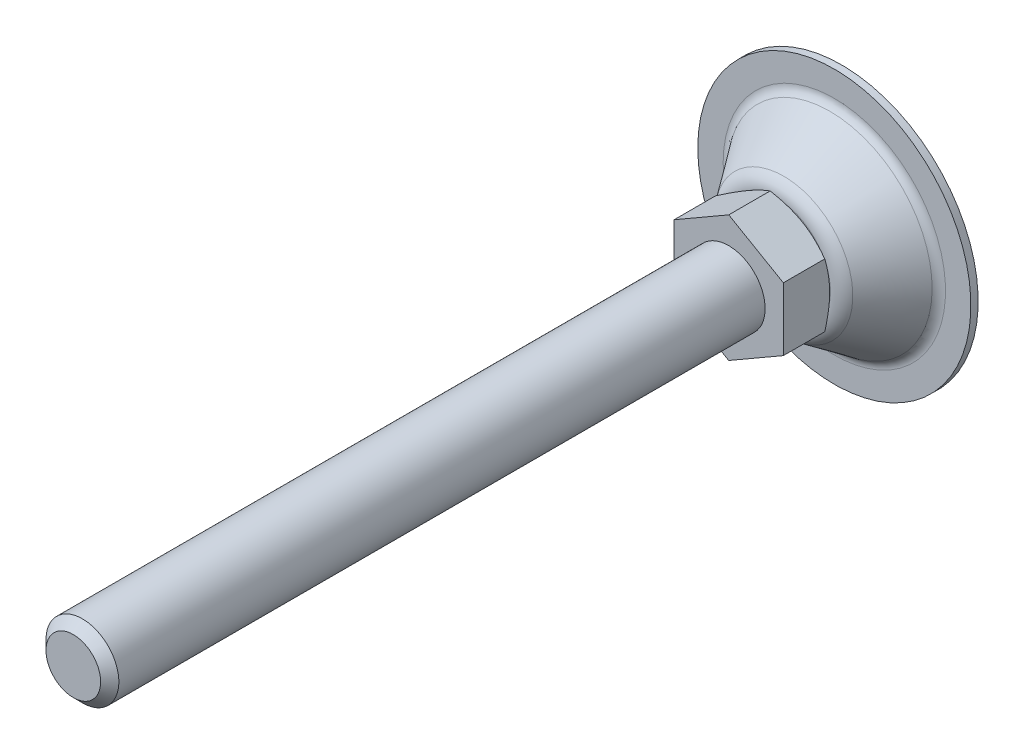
ISO-10303-21;
HEADER;
FILE_DESCRIPTION(('STEP AP214'),'2;1');
FILE_NAME('part.step','',(''),(''),'','','');
FILE_SCHEMA(('AUTOMOTIVE_DESIGN { 1 0 10303 214 1 1 1 1 }'));
ENDSEC;
DATA;
#1=APPLICATION_CONTEXT('core data for automotive mechanical design processes');
#2=APPLICATION_PROTOCOL_DEFINITION('international standard','automotive_design',2000,#1);
#3=PRODUCT_CONTEXT('',#1,'mechanical');
#4=PRODUCT('Part','Part','',(#3));
#5=PRODUCT_RELATED_PRODUCT_CATEGORY('part','',(#4));
#6=PRODUCT_DEFINITION_FORMATION('','',#4);
#7=PRODUCT_DEFINITION_CONTEXT('part definition',#1,'design');
#8=PRODUCT_DEFINITION('design','',#6,#7);
#9=PRODUCT_DEFINITION_SHAPE('','',#8);
#10=(LENGTH_UNIT() NAMED_UNIT(*) SI_UNIT(.MILLI.,.METRE.));
#11=(NAMED_UNIT(*) PLANE_ANGLE_UNIT() SI_UNIT($,.RADIAN.));
#12=(NAMED_UNIT(*) SI_UNIT($,.STERADIAN.) SOLID_ANGLE_UNIT());
#13=UNCERTAINTY_MEASURE_WITH_UNIT(LENGTH_MEASURE(1.E-05),#10,'distance_accuracy_value','');
#14=(GEOMETRIC_REPRESENTATION_CONTEXT(3) GLOBAL_UNCERTAINTY_ASSIGNED_CONTEXT((#13)) GLOBAL_UNIT_ASSIGNED_CONTEXT((#10,
#11,#12)) REPRESENTATION_CONTEXT('',''));
#15=CARTESIAN_POINT('',(0.,0.,0.));
#16=DIRECTION('',(0.,0.,1.));
#17=DIRECTION('',(1.,0.,0.));
#18=AXIS2_PLACEMENT_3D('',#15,#16,#17);
#19=CARTESIAN_POINT('',(0.,0.,31.));
#20=DIRECTION('',(0.,0.,1.));
#21=DIRECTION('',(0.5,-0.86602540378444,0.));
#22=AXIS2_PLACEMENT_3D('',#19,#20,#21);
#23=PLANE('',#22);
#24=DIRECTION('',(0.,1.,0.));
#25=VECTOR('',#24,1.);
#26=CARTESIAN_POINT('',(15.,-8.66025403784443,31.));
#27=LINE('',#26,#25);
#28=CARTESIAN_POINT('',(15.,-8.66025403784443,31.));
#29=VERTEX_POINT('',#28);
#30=CARTESIAN_POINT('',(15.,8.66025403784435,31.));
#31=VERTEX_POINT('',#30);
#32=EDGE_CURVE('E220',#29,#31,#27,.T.);
#33=ORIENTED_EDGE('',*,*,#32,.T.);
#34=DIRECTION('',(-0.866025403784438,0.5,0.));
#35=VECTOR('',#34,1.);
#36=CARTESIAN_POINT('',(15.,8.66025403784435,31.));
#37=LINE('',#36,#35);
#38=CARTESIAN_POINT('',(0.,17.3205080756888,31.));
#39=VERTEX_POINT('',#38);
#40=EDGE_CURVE('E266',#31,#39,#37,.T.);
#41=ORIENTED_EDGE('',*,*,#40,.T.);
#42=DIRECTION('',(-0.866025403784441,-0.5,0.));
#43=VECTOR('',#42,1.);
#44=CARTESIAN_POINT('',(0.,17.3205080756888,31.));
#45=LINE('',#44,#43);
#46=CARTESIAN_POINT('',(-15.,8.66025403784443,31.));
#47=VERTEX_POINT('',#46);
#48=EDGE_CURVE('E264',#39,#47,#45,.T.);
#49=ORIENTED_EDGE('',*,*,#48,.T.);
#50=DIRECTION('',(0.,-1.,0.));
#51=VECTOR('',#50,1.);
#52=CARTESIAN_POINT('',(-15.,8.66025403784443,31.));
#53=LINE('',#52,#51);
#54=CARTESIAN_POINT('',(-15.,-8.66025403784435,31.));
#55=VERTEX_POINT('',#54);
#56=EDGE_CURVE('E261',#47,#55,#53,.T.);
#57=ORIENTED_EDGE('',*,*,#56,.T.);
#58=DIRECTION('',(0.866025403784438,-0.5,0.));
#59=VECTOR('',#58,1.);
#60=CARTESIAN_POINT('',(-15.,-8.66025403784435,31.));
#61=LINE('',#60,#59);
#62=CARTESIAN_POINT('',(0.,-17.3205080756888,31.));
#63=VERTEX_POINT('',#62);
#64=EDGE_CURVE('E271',#55,#63,#61,.T.);
#65=ORIENTED_EDGE('',*,*,#64,.T.);
#66=DIRECTION('',(0.866025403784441,0.5,0.));
#67=VECTOR('',#66,1.);
#68=CARTESIAN_POINT('',(0.,-17.3205080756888,31.));
#69=LINE('',#68,#67);
#70=EDGE_CURVE('E37',#63,#29,#69,.T.);
#71=ORIENTED_EDGE('',*,*,#70,.T.);
#72=EDGE_LOOP('',(#33,#41,#49,#57,#65,#71));
#73=FACE_BOUND('',#72,.T.);
#74=CARTESIAN_POINT('',(0.,0.,31.));
#75=DIRECTION('',(0.,0.,1.));
#76=DIRECTION('',(0.5,-0.86602540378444,0.));
#77=AXIS2_PLACEMENT_3D('',#74,#75,#76);
#78=CIRCLE('',#77,10.);
#79=CARTESIAN_POINT('',(5.,-8.6602540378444,31.));
#80=VERTEX_POINT('',#79);
#81=EDGE_CURVE('E224',#80,#80,#78,.T.);
#82=ORIENTED_EDGE('',*,*,#81,.F.);
#83=EDGE_LOOP('',(#82));
#84=FACE_BOUND('',#83,.T.);
#85=ADVANCED_FACE('F14',(#73,#84),#23,.T.);
#86=CARTESIAN_POINT('',(-1.54390389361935E-13,2.67411998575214E-13,4.9999999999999));
#87=DIRECTION('',(0.,0.,1.));
#88=DIRECTION('',(0.5,-0.86602540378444,0.));
#89=AXIS2_PLACEMENT_3D('',#86,#87,#88);
#90=TOROIDAL_SURFACE('',#89,30.5382613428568,3.);
#91=CARTESIAN_POINT('',(-1.55741344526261E-13,2.69751921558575E-13,3.24909185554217));
#92=DIRECTION('',(0.,0.,1.));
#93=DIRECTION('',(0.5,-0.86602540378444,0.));
#94=AXIS2_PLACEMENT_3D('',#91,#92,#93);
#95=CIRCLE('',#94,28.1022152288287);
#96=CARTESIAN_POINT('',(14.0511076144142,-24.3372322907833,3.2490918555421));
#97=VERTEX_POINT('',#96);
#98=EDGE_CURVE('E73',#97,#97,#95,.T.);
#99=ORIENTED_EDGE('',*,*,#98,.F.);
#100=EDGE_LOOP('',(#99));
#101=FACE_BOUND('',#100,.T.);
#102=CARTESIAN_POINT('',(-1.57301461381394E-13,2.72454123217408E-13,1.99999999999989));
#103=DIRECTION('',(0.,0.,1.));
#104=DIRECTION('',(0.5,-0.86602540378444,0.));
#105=AXIS2_PLACEMENT_3D('',#102,#103,#104);
#106=CIRCLE('',#105,30.5382613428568);
#107=CARTESIAN_POINT('',(15.2691306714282,-26.446910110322,1.99999999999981));
#108=VERTEX_POINT('',#107);
#109=EDGE_CURVE('E102',#108,#108,#106,.T.);
#110=ORIENTED_EDGE('',*,*,#109,.T.);
#111=EDGE_LOOP('',(#110));
#112=FACE_BOUND('',#111,.T.);
#113=ADVANCED_FACE('F198',(#101,#112),#90,.F.);
#114=CARTESIAN_POINT('',(-1.55741344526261E-13,2.69751921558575E-13,3.24909185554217));
#115=DIRECTION('',(0.,0.,-1.));
#116=DIRECTION('',(-0.5,0.86602540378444,0.));
#117=AXIS2_PLACEMENT_3D('',#114,#115,#116);
#118=CONICAL_SURFACE('',#117,28.1022152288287,0.623199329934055);
#119=CARTESIAN_POINT('',(-1.39917641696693E-13,2.42344464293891E-13,15.9181802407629));
#120=DIRECTION('',(0.,0.,1.));
#121=DIRECTION('',(0.5,-0.86602540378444,0.));
#122=AXIS2_PLACEMENT_3D('',#119,#120,#121);
#123=CIRCLE('',#122,18.9963079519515);
#124=CARTESIAN_POINT('',(9.49815397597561,-16.4512852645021,15.9181802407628));
#125=VERTEX_POINT('',#124);
#126=EDGE_CURVE('E111',#125,#125,#123,.T.);
#127=ORIENTED_EDGE('',*,*,#126,.F.);
#128=EDGE_LOOP('',(#127));
#129=FACE_BOUND('',#128,.T.);
#130=ORIENTED_EDGE('',*,*,#98,.T.);
#131=EDGE_LOOP('',(#130));
#132=FACE_BOUND('',#131,.T.);
#133=ADVANCED_FACE('F195',(#129,#132),#118,.T.);
#134=CARTESIAN_POINT('',(-1.43982048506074E-13,2.49384223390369E-13,13.));
#135=DIRECTION('',(0.,0.,1.));
#136=DIRECTION('',(0.5,-0.86602540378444,0.));
#137=AXIS2_PLACEMENT_3D('',#134,#135,#136);
#138=TOROIDAL_SURFACE('',#137,14.9362310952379,5.);
#139=CARTESIAN_POINT('',(-1.43982048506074E-13,2.49384223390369E-13,18.));
#140=DIRECTION('',(0.,0.,1.));
#141=DIRECTION('',(0.5,-0.86602540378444,0.));
#142=AXIS2_PLACEMENT_3D('',#139,#140,#141);
#143=CIRCLE('',#142,14.9362310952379);
#144=CARTESIAN_POINT('',(7.46811554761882,-12.9351555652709,18.));
#145=VERTEX_POINT('',#144);
#146=EDGE_CURVE('E84',#145,#145,#143,.T.);
#147=ORIENTED_EDGE('',*,*,#146,.F.);
#148=EDGE_LOOP('',(#147));
#149=FACE_BOUND('',#148,.T.);
#150=ORIENTED_EDGE('',*,*,#126,.T.);
#151=EDGE_LOOP('',(#150));
#152=FACE_BOUND('',#151,.T.);
#153=ADVANCED_FACE('F191',(#149,#152),#138,.T.);
#154=CARTESIAN_POINT('',(-18.75,32.4759526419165,0.));
#155=DIRECTION('',(0.,0.,1.));
#156=DIRECTION('',(0.5,-0.86602540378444,0.));
#157=AXIS2_PLACEMENT_3D('',#154,#155,#156);
#158=PLANE('',#157);
#159=CARTESIAN_POINT('',(-1.59799463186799E-13,2.76780789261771E-13,-1.38777878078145E-13));
#160=DIRECTION('',(0.,0.,1.));
#161=DIRECTION('',(0.5,-0.86602540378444,0.));
#162=AXIS2_PLACEMENT_3D('',#159,#160,#161);
#163=CIRCLE('',#162,37.5);
#164=CARTESIAN_POINT('',(18.7499999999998,-32.4759526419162,-2.32452945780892E-13));
#165=VERTEX_POINT('',#164);
#166=EDGE_CURVE('E108',#165,#165,#163,.T.);
#167=ORIENTED_EDGE('',*,*,#166,.F.);
#168=EDGE_LOOP('',(#167));
#169=FACE_BOUND('',#168,.T.);
#170=ADVANCED_FACE('F187',(#169),#158,.F.);
#171=CARTESIAN_POINT('',(0.,0.,129.670029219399));
#172=DIRECTION('',(0.,0.,1.));
#173=DIRECTION('',(0.5,-0.86602540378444,0.));
#174=AXIS2_PLACEMENT_3D('',#171,#172,#173);
#175=CYLINDRICAL_SURFACE('',#174,37.5);
#176=CARTESIAN_POINT('',(-1.57301461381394E-13,2.72454123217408E-13,1.99999999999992));
#177=DIRECTION('',(0.,0.,1.));
#178=DIRECTION('',(0.5,-0.86602540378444,0.));
#179=AXIS2_PLACEMENT_3D('',#176,#177,#178);
#180=CIRCLE('',#179,37.5);
#181=CARTESIAN_POINT('',(18.7499999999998,-32.4759526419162,1.99999999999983));
#182=VERTEX_POINT('',#181);
#183=EDGE_CURVE('E105',#182,#182,#180,.T.);
#184=ORIENTED_EDGE('',*,*,#183,.F.);
#185=EDGE_LOOP('',(#184));
#186=FACE_BOUND('',#185,.T.);
#187=ORIENTED_EDGE('',*,*,#166,.T.);
#188=EDGE_LOOP('',(#187));
#189=FACE_BOUND('',#188,.T.);
#190=ADVANCED_FACE('F183',(#186,#189),#175,.T.);
#191=CARTESIAN_POINT('',(-18.75,32.4759526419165,2.));
#192=DIRECTION('',(0.,0.,-1.));
#193=DIRECTION('',(-0.5,0.86602540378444,0.));
#194=AXIS2_PLACEMENT_3D('',#191,#192,#193);
#195=PLANE('',#194);
#196=ORIENTED_EDGE('',*,*,#109,.F.);
#197=EDGE_LOOP('',(#196));
#198=FACE_BOUND('',#197,.T.);
#199=ORIENTED_EDGE('',*,*,#183,.T.);
#200=EDGE_LOOP('',(#199));
#201=FACE_BOUND('',#200,.T.);
#202=ADVANCED_FACE('F128',(#198,#201),#195,.F.);
#203=CARTESIAN_POINT('',(0.,0.,23.0943491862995));
#204=DIRECTION('',(0.,0.,1.));
#205=DIRECTION('',(0.5,-0.86602540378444,0.));
#206=AXIS2_PLACEMENT_3D('',#203,#204,#205);
#207=CONICAL_SURFACE('',#206,23.323671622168,1.0471975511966);
#208=CARTESIAN_POINT('',(0.,0.,18.));
#209=DIRECTION('',(0.,0.,-1.));
#210=DIRECTION('',(-0.5,0.86602540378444,0.));
#211=AXIS2_PLACEMENT_3D('',#208,#209,#210);
#212=CIRCLE('',#211,14.5);
#213=CARTESIAN_POINT('',(-7.25,12.5573683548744,18.));
#214=VERTEX_POINT('',#213);
#215=EDGE_CURVE('E226',#214,#214,#212,.T.);
#216=ORIENTED_EDGE('',*,*,#215,.F.);
#217=EDGE_LOOP('',(#216));
#218=FACE_BOUND('',#217,.T.);
#219=CARTESIAN_POINT('',(-12.7752963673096,-24.6963288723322,25.6816332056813));
#220=CARTESIAN_POINT('',(-12.4910694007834,-24.5322303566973,25.5220895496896));
#221=CARTESIAN_POINT('',(-12.206512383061,-24.3679412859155,25.3633302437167));
#222=CARTESIAN_POINT('',(-11.6366694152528,-24.0389422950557,25.0475576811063));
#223=CARTESIAN_POINT('',(-11.3513834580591,-23.8742323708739,24.8905444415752));
#224=CARTESIAN_POINT('',(-10.4942547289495,-23.3793688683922,24.4223494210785));
#225=CARTESIAN_POINT('',(-9.92122319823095,-23.0485289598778,24.1140585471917));
#226=CARTESIAN_POINT('',(-8.76831153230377,-22.3828950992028,23.5053939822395));
#227=CARTESIAN_POINT('',(-8.18841117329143,-22.0480894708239,23.2050712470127));
#228=CARTESIAN_POINT('',(-7.02404380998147,-21.3758416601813,22.6165131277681));
#229=CARTESIAN_POINT('',(-6.43957701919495,-21.0383996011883,22.3282771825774));
#230=CARTESIAN_POINT('',(-5.24579106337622,-20.3491669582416,21.7578369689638));
#231=CARTESIAN_POINT('',(-4.6362875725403,-19.9972699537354,21.4761443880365));
#232=CARTESIAN_POINT('',(-3.41019349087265,-19.2893842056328,20.9337181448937));
#233=CARTESIAN_POINT('',(-2.79360212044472,-18.9333950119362,20.6729868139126));
#234=CARTESIAN_POINT('',(-1.55348395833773,-18.2174124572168,20.1792225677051));
#235=CARTESIAN_POINT('',(-0.929973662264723,-17.8574286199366,19.9461348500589));
#236=CARTESIAN_POINT('',(0.326048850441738,-17.1322636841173,19.5150244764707));
#237=CARTESIAN_POINT('',(0.958558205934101,-16.7670842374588,19.3169909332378));
#238=CARTESIAN_POINT('',(1.91243675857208,-16.216362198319,19.0538662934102));
#239=CARTESIAN_POINT('',(2.2303543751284,-16.0328123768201,18.9719940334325));
#240=CARTESIAN_POINT('',(2.8683856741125,-15.6644448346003,18.8205188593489));
#241=CARTESIAN_POINT('',(3.18849931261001,-15.4796271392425,18.7509157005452));
#242=CARTESIAN_POINT('',(3.83071190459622,-15.1088455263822,18.6251978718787));
#243=CARTESIAN_POINT('',(4.15281082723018,-14.9228816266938,18.5690829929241));
#244=CARTESIAN_POINT('',(4.79866142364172,-14.5499996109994,18.4714557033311));
#245=CARTESIAN_POINT('',(5.12241302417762,-14.3630815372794,18.4299426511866));
#246=CARTESIAN_POINT('',(5.7668346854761,-13.9910245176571,18.3628722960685));
#247=CARTESIAN_POINT('',(6.08748870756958,-13.8058948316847,18.3371107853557));
#248=CARTESIAN_POINT('',(6.72945271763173,-13.4352567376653,18.3012764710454));
#249=CARTESIAN_POINT('',(7.05076269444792,-13.2497483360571,18.2912034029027));
#250=CARTESIAN_POINT('',(7.69346432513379,-12.878684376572,18.2869861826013));
#251=CARTESIAN_POINT('',(8.0148559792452,-12.6931288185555,18.2928420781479));
#252=CARTESIAN_POINT('',(8.65713622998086,-12.3223081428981,18.3203381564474));
#253=CARTESIAN_POINT('',(8.9780248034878,-12.1370430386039,18.3419790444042));
#254=CARTESIAN_POINT('',(9.74531187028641,-11.694049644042,18.4121345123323));
#255=CARTESIAN_POINT('',(10.1912229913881,-11.4366027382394,18.4678874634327));
#256=CARTESIAN_POINT('',(11.0798234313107,-10.9235690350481,18.6068735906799));
#257=CARTESIAN_POINT('',(11.5225123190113,-10.6679824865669,18.6901103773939));
#258=CARTESIAN_POINT('',(12.4042155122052,-10.158930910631,18.881103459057));
#259=CARTESIAN_POINT('',(12.84322676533,-9.90546764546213,18.988878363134));
#260=CARTESIAN_POINT('',(13.7168888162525,-9.40105862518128,19.2256508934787));
#261=CARTESIAN_POINT('',(14.151539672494,-9.15011283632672,19.3546482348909));
#262=CARTESIAN_POINT('',(15.0261682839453,-8.64514577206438,19.6338079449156));
#263=CARTESIAN_POINT('',(15.466047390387,-8.39118145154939,19.7843795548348));
#264=CARTESIAN_POINT('',(16.3414739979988,-7.8857536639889,20.1013827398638));
#265=CARTESIAN_POINT('',(16.7770214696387,-7.63429021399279,20.267814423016));
#266=CARTESIAN_POINT('',(17.6439961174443,-7.13374216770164,20.6138686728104));
#267=CARTESIAN_POINT('',(18.0754245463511,-6.88465684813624,20.7934870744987));
#268=CARTESIAN_POINT('',(18.9346884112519,-6.38856062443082,21.1637718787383));
#269=CARTESIAN_POINT('',(19.3625238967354,-6.14154969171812,21.3544381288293));
#270=CARTESIAN_POINT('',(20.4004383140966,-5.54230952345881,21.829942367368));
#271=CARTESIAN_POINT('',(21.0088362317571,-5.19105082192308,22.1196663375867));
#272=CARTESIAN_POINT('',(22.2202116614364,-4.49166289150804,22.7138939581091));
#273=CARTESIAN_POINT('',(22.8231887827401,-4.14353388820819,23.0183986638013));
#274=CARTESIAN_POINT('',(24.0247789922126,-3.44979545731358,23.6391170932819));
#275=CARTESIAN_POINT('',(24.6233909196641,-3.10418669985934,23.9553338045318));
#276=CARTESIAN_POINT('',(25.8168545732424,-2.41514013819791,24.5970218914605));
#277=CARTESIAN_POINT('',(26.4117063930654,-2.07170227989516,24.9224930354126));
#278=CARTESIAN_POINT('',(27.5990157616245,-1.38620889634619,25.5812970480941));
#279=CARTESIAN_POINT('',(28.1914695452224,-1.04415554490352,25.9146389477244));
#280=CARTESIAN_POINT('',(29.3737746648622,-0.36155136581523,26.5874202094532));
#281=CARTESIAN_POINT('',(29.9636259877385,-0.0210005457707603,26.9268596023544));
#282=CARTESIAN_POINT('',(31.1410545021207,0.658788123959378,27.6107079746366));
#283=CARTESIAN_POINT('',(31.728632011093,0.998026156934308,27.9551162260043));
#284=CARTESIAN_POINT('',(32.9019328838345,1.67543173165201,28.6481104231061));
#285=CARTESIAN_POINT('',(33.4876562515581,2.01359927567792,28.9966963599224));
#286=CARTESIAN_POINT('',(35.1389838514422,2.96699370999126,29.9857106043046));
#287=CARTESIAN_POINT('',(36.2027654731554,3.5811683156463,30.6301961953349));
#288=CARTESIAN_POINT('',(38.3264251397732,4.80726379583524,31.9277855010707));
#289=CARTESIAN_POINT('',(39.3863030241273,5.4191845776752,32.5808895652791));
#290=CARTESIAN_POINT('',(41.5001458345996,6.63961229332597,33.8918828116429));
#291=CARTESIAN_POINT('',(42.5541189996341,7.24812398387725,34.5497542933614));
#292=CARTESIAN_POINT('',(44.1332517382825,8.15983669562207,35.5403535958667));
#293=CARTESIAN_POINT('',(44.6593093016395,8.46355617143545,35.8711755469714));
#294=CARTESIAN_POINT('',(45.7108863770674,9.07068447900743,36.5339556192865));
#295=CARTESIAN_POINT('',(46.2364058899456,9.37409331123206,36.865913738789));
#296=CARTESIAN_POINT('',(46.7616874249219,9.67736474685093,37.1983733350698));
#297=B_SPLINE_CURVE_WITH_KNOTS('',3,(#219,#220,#221,#222,#223,#224,#225,#226,#227,#228,#229,
#230,#231,#232,#233,#234,#235,#236,#237,#238,#239,#240,#241,#242,#243,#244,#245,#246,#247,#248,
#249,#250,#251,#252,#253,#254,#255,#256,#257,#258,#259,#260,#261,#262,#263,#264,#265,#266,#267,
#268,#269,#270,#271,#272,#273,#274,#275,#276,#277,#278,#279,#280,#281,#282,#283,#284,#285,#286,
#287,#288,#289,#290,#291,#292,#293,#294,#295,#296),.UNSPECIFIED.,.F.,.F.,(4,2,2,2,2,2,2,2,2,2,2,
2,2,2,2,2,2,2,2,2,2,2,2,2,2,2,2,2,2,2,2,2,2,2,2,2,2,2,4),(0.,1.09476161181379,2.18953393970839,
4.37939496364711,6.58092776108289,8.7823582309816,11.0563262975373,13.3305469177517,
15.6001808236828,17.869108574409,18.9972925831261,20.1254540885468,21.2535981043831,
22.3816925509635,23.4948335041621,24.6079556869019,25.7210812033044,26.8342564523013,
28.3871111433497,29.9401699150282,31.4944104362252,33.0486300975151,34.6376511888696,
36.2266831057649,37.815215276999,39.4037255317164,41.6832356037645,43.9629086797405,
46.2431673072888,48.5233688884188,50.8063278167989,53.0892982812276,55.3719375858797,
57.6545720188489,61.8159896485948,65.9775765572,70.1279174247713,72.2029652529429,
74.2780099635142),.UNSPECIFIED.);
#298=CARTESIAN_POINT('',(0.,-17.3205080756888,19.6284210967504));
#299=VERTEX_POINT('',#298);
#300=CARTESIAN_POINT('',(15.,-8.66025403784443,19.6284210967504));
#301=VERTEX_POINT('',#300);
#302=EDGE_CURVE('E65',#299,#301,#297,.T.);
#303=ORIENTED_EDGE('',*,*,#302,.F.);
#304=CARTESIAN_POINT('',(-15.0002,-8.66013856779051,19.6284877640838));
#305=CARTESIAN_POINT('',(-14.6705058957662,-8.85048754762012,19.5185969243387));
#306=CARTESIAN_POINT('',(-14.3395258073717,-9.04157899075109,19.4136927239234));
#307=CARTESIAN_POINT('',(-13.674911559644,-9.42529420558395,19.2152437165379));
#308=CARTESIAN_POINT('',(-13.3412765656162,-9.61791845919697,19.1217026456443));
#309=CARTESIAN_POINT('',(-12.6707077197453,-10.0050715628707,18.9472372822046));
#310=CARTESIAN_POINT('',(-12.333767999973,-10.1996038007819,18.866342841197));
#311=CARTESIAN_POINT('',(-11.6575472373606,-10.5900200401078,18.7189077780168));
#312=CARTESIAN_POINT('',(-11.3182663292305,-10.7859039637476,18.6523663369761));
#313=CARTESIAN_POINT('',(-10.6460568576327,-11.1740042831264,18.5364675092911));
#314=CARTESIAN_POINT('',(-10.3131781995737,-11.3661918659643,18.4867265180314));
#315=CARTESIAN_POINT('',(-9.64589556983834,-11.7514476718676,18.4033218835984));
#316=CARTESIAN_POINT('',(-9.31149156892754,-11.9445159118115,18.3696585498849));
#317=CARTESIAN_POINT('',(-8.64212181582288,-12.3309767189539,18.3192592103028));
#318=CARTESIAN_POINT('',(-8.30715720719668,-12.5243686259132,18.3025030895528));
#319=CARTESIAN_POINT('',(-7.63691878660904,-12.9113309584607,18.2862785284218));
#320=CARTESIAN_POINT('',(-7.3016449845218,-13.104901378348,18.2868095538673));
#321=CARTESIAN_POINT('',(-6.67485311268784,-13.4667798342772,18.303951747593));
#322=CARTESIAN_POINT('',(-6.38329037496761,-13.6351136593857,18.3184719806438));
#323=CARTESIAN_POINT('',(-5.80083556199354,-13.971394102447,18.3603122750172));
#324=CARTESIAN_POINT('',(-5.50994353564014,-14.1393406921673,18.3876332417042));
#325=CARTESIAN_POINT('',(-4.9289881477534,-14.4747554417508,18.4545986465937));
#326=CARTESIAN_POINT('',(-4.63892567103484,-14.6422230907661,18.4942532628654));
#327=CARTESIAN_POINT('',(-4.06016058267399,-14.9763732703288,18.5851902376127));
#328=CARTESIAN_POINT('',(-3.77145806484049,-15.1430557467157,18.636473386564));
#329=CARTESIAN_POINT('',(-2.89508556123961,-15.6490296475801,18.8090619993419));
#330=CARTESIAN_POINT('',(-2.30995340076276,-15.9868558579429,18.9475763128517));
#331=CARTESIAN_POINT('',(-1.14841408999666,-16.657470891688,19.26194710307));
#332=CARTESIAN_POINT('',(-0.571992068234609,-16.9902683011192,19.4377297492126));
#333=CARTESIAN_POINT('',(0.000199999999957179,-17.3206235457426,19.6284877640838));
#334=B_SPLINE_CURVE_WITH_KNOTS('',3,(#304,#305,#306,#307,#308,#309,#310,#311,#312,#313,#314,
#315,#316,#317,#318,#319,#320,#321,#322,#323,#324,#325,#326,#327,#328,#329,#330,#331,#332,#333),
.UNSPECIFIED.,.F.,.F.,(4,2,2,2,2,2,2,2,2,2,2,2,2,2,4),(0.,1.18875411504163,2.37789802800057,
3.56980778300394,4.76164951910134,5.92407379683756,7.08652044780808,8.24758247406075,
9.40860862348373,10.4193068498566,11.4300765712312,12.4416826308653,13.4533574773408,
15.5211962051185,17.5849760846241),.UNSPECIFIED.);
#335=CARTESIAN_POINT('',(-15.,-8.66025403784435,19.6284210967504));
#336=VERTEX_POINT('',#335);
#337=EDGE_CURVE('E68',#336,#299,#334,.T.);
#338=ORIENTED_EDGE('',*,*,#337,.F.);
#339=CARTESIAN_POINT('',(-15.,8.66048497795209,19.6284877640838));
#340=CARTESIAN_POINT('',(-15.,8.27978701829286,19.5185969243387));
#341=CARTESIAN_POINT('',(-15.,7.89760413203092,19.4136927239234));
#342=CARTESIAN_POINT('',(-15.,7.1301737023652,19.2152437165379));
#343=CARTESIAN_POINT('',(-15.,6.74492519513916,19.1217026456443));
#344=CARTESIAN_POINT('',(-15.,5.97061898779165,18.9472372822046));
#345=CARTESIAN_POINT('',(-15.,5.58155451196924,18.866342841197));
#346=CARTESIAN_POINT('',(-15.,4.80072203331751,18.7189077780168));
#347=CARTESIAN_POINT('',(-15.,4.40895418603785,18.6523663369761));
#348=CARTESIAN_POINT('',(-15.,3.63275354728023,18.5364675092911));
#349=CARTESIAN_POINT('',(-15.,3.24837838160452,18.4867265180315));
#350=CARTESIAN_POINT('',(-15.,2.47786676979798,18.4033218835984));
#351=CARTESIAN_POINT('',(-15.,2.09173028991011,18.3696585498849));
#352=CARTESIAN_POINT('',(-15.,1.31880867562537,18.3192592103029));
#353=CARTESIAN_POINT('',(-15.,0.932024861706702,18.3025030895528));
#354=CARTESIAN_POINT('',(-15.,0.158100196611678,18.2862785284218));
#355=CARTESIAN_POINT('',(-15.,-0.229040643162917,18.2868095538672));
#356=CARTESIAN_POINT('',(-15.,-0.95279755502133,18.303951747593));
#357=CARTESIAN_POINT('',(-15.,-1.2894652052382,18.3184719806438));
#358=CARTESIAN_POINT('',(-15.,-1.96202609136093,18.3603122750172));
#359=CARTESIAN_POINT('',(-15.,-2.29791927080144,18.3876332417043));
#360=CARTESIAN_POINT('',(-15.,-2.96874876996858,18.4545986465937));
#361=CARTESIAN_POINT('',(-15.,-3.30368406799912,18.4942532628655));
#362=CARTESIAN_POINT('',(-15.,-3.97198442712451,18.5851902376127));
#363=CARTESIAN_POINT('',(-15.,-4.30534937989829,18.636473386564));
#364=CARTESIAN_POINT('',(-15.,-5.317297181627,18.8090619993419));
#365=CARTESIAN_POINT('',(-15.,-5.99294960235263,18.9475763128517));
#366=CARTESIAN_POINT('',(-15.,-7.33417966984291,19.26194710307));
#367=CARTESIAN_POINT('',(-15.,-7.99977448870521,19.4377297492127));
#368=CARTESIAN_POINT('',(-15.,-8.66048497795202,19.6284877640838));
#369=B_SPLINE_CURVE_WITH_KNOTS('',3,(#339,#340,#341,#342,#343,#344,#345,#346,#347,#348,#349,
#350,#351,#352,#353,#354,#355,#356,#357,#358,#359,#360,#361,#362,#363,#364,#365,#366,#367,#368),
.UNSPECIFIED.,.F.,.F.,(4,2,2,2,2,2,2,2,2,2,2,2,2,2,4),(0.,1.18875411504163,2.37789802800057,
3.56980778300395,4.76164951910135,5.92407379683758,7.08652044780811,8.24758247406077,
9.40860862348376,10.4193068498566,11.4300765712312,12.4416826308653,13.4533574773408,
15.5211962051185,17.5849760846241),.UNSPECIFIED.);
#370=CARTESIAN_POINT('',(-15.,8.66025403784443,19.6284210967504));
#371=VERTEX_POINT('',#370);
#372=EDGE_CURVE('E83',#371,#336,#369,.T.);
#373=ORIENTED_EDGE('',*,*,#372,.F.);
#374=CARTESIAN_POINT('',(-27.7752963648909,1.28443324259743,25.6816332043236));
#375=CARTESIAN_POINT('',(-27.4910693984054,1.44853175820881,25.5220895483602));
#376=CARTESIAN_POINT('',(-27.2065123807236,1.61282082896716,25.3633302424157));
#377=CARTESIAN_POINT('',(-26.6366694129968,1.94181981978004,25.0475576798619));
#378=CARTESIAN_POINT('',(-26.3513834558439,2.10652974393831,24.8905444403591));
#379=CARTESIAN_POINT('',(-25.4942547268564,2.60139324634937,24.4223494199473));
#380=CARTESIAN_POINT('',(-24.9212231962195,2.93223315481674,24.1140585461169));
#381=CARTESIAN_POINT('',(-23.7683115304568,3.59786701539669,23.5053939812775));
#382=CARTESIAN_POINT('',(-23.1884111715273,3.93267264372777,23.2050712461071));
#383=CARTESIAN_POINT('',(-22.0240438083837,4.60492045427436,22.6165131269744));
#384=CARTESIAN_POINT('',(-21.4395770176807,4.94236251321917,22.3282771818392));
#385=CARTESIAN_POINT('',(-20.2457910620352,5.63159515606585,21.7578369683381));
#386=CARTESIAN_POINT('',(-19.6362875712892,5.98349216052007,21.4761443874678));
#387=CARTESIAN_POINT('',(-18.4101934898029,6.69137790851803,20.9337181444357));
#388=CARTESIAN_POINT('',(-17.7936021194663,7.04736710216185,20.6729868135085));
#389=CARTESIAN_POINT('',(-16.5534839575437,7.76334965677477,20.1792225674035));
#390=CARTESIAN_POINT('',(-15.9299736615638,8.1233334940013,19.946134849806));
#391=CARTESIAN_POINT('',(-14.673951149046,8.84849842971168,19.5150244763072));
#392=CARTESIAN_POINT('',(-14.0414417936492,9.21367787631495,19.316990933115));
#393=CARTESIAN_POINT('',(-13.0875632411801,9.76439991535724,19.0538662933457));
#394=CARTESIAN_POINT('',(-12.769645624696,9.94794973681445,18.9719940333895));
#395=CARTESIAN_POINT('',(-12.1316143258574,10.3163172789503,18.8205188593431));
#396=CARTESIAN_POINT('',(-11.8115006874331,10.5011349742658,18.7509157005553));
#397=CARTESIAN_POINT('',(-11.1692880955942,10.871916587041,18.6251978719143));
#398=CARTESIAN_POINT('',(-10.8471891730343,11.0578804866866,18.5690829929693));
#399=CARTESIAN_POINT('',(-10.2013385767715,11.4307625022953,18.4714557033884));
#400=CARTESIAN_POINT('',(-9.87758697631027,11.6176805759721,18.4299426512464));
#401=CARTESIAN_POINT('',(-9.23316531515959,11.9897375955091,18.3628722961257));
#402=CARTESIAN_POINT('',(-8.91251129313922,12.1748672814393,18.337110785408));
#403=CARTESIAN_POINT('',(-8.27054728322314,12.5455053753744,18.3012764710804));
#404=CARTESIAN_POINT('',(-7.9492373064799,12.7310137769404,18.2912034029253));
#405=CARTESIAN_POINT('',(-7.3065356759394,13.1020777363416,18.2869861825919));
#406=CARTESIAN_POINT('',(-6.98514402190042,13.2876332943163,18.2928420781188));
#407=CARTESIAN_POINT('',(-6.34286377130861,13.6584539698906,18.3203381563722));
#408=CARTESIAN_POINT('',(-6.02197519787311,13.8437190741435,18.3419790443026));
#409=CARTESIAN_POINT('',(-5.25468813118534,14.2867124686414,18.4121345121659));
#410=CARTESIAN_POINT('',(-4.80877701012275,14.5441593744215,18.4678874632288));
#411=CARTESIAN_POINT('',(-3.92017657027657,15.0571930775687,18.6068735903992));
#412=CARTESIAN_POINT('',(-3.47748768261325,15.3127796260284,18.6901103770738));
#413=CARTESIAN_POINT('',(-2.59578448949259,15.821831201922,18.8811034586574));
#414=CARTESIAN_POINT('',(-2.15677323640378,16.0752944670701,18.9888783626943));
#415=CARTESIAN_POINT('',(-1.28311118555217,16.57970348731,19.2256508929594));
#416=CARTESIAN_POINT('',(-0.84846032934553,16.8306492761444,19.3546482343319));
#417=CARTESIAN_POINT('',(0.0261682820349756,17.3356163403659,19.6338079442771));
#418=CARTESIAN_POINT('',(0.466047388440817,17.5895806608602,19.7843795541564));
#419=CARTESIAN_POINT('',(1.34147399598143,18.0950084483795,20.1013827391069));
#420=CARTESIAN_POINT('',(1.7770214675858,18.3464718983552,20.2678144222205));
#421=CARTESIAN_POINT('',(2.64399611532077,18.8470199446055,20.6138686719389));
#422=CARTESIAN_POINT('',(3.07542454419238,19.0961052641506,20.7934870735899));
#423=CARTESIAN_POINT('',(3.93468840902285,19.5922014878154,21.1637718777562));
#424=CARTESIAN_POINT('',(4.36252389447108,19.8392124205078,21.3544381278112));
#425=CARTESIAN_POINT('',(5.40043831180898,20.4384525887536,21.8299423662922));
#426=CARTESIAN_POINT('',(6.0088362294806,20.7897112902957,22.1196663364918));
#427=CARTESIAN_POINT('',(7.22021165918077,21.4890992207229,22.7138939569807));
#428=CARTESIAN_POINT('',(7.82318878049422,21.8372282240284,23.0183986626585));
#429=CARTESIAN_POINT('',(9.0247789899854,22.5309666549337,23.639117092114));
#430=CARTESIAN_POINT('',(9.62339091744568,22.876575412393,23.955333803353));
#431=CARTESIAN_POINT('',(10.8168545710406,23.5656219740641,24.5970218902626));
#432=CARTESIAN_POINT('',(11.4117063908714,23.9090598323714,24.9224930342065));
#433=CARTESIAN_POINT('',(12.5990157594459,24.5945532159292,25.5812970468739));
#434=CARTESIAN_POINT('',(13.1914695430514,24.9366065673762,25.9146389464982));
#435=CARTESIAN_POINT('',(14.3737746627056,25.6192107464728,26.5874202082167));
#436=CARTESIAN_POINT('',(14.9636259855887,25.9597615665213,26.9268596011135));
#437=CARTESIAN_POINT('',(16.1410544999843,26.6395502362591,27.6107079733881));
#438=CARTESIAN_POINT('',(16.728632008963,26.9787882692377,27.9551162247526));
#439=CARTESIAN_POINT('',(17.9019328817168,27.6561938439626,28.6481104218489));
#440=CARTESIAN_POINT('',(18.4876562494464,27.9943613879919,28.996696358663));
#441=CARTESIAN_POINT('',(20.1389838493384,28.9477558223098,29.9857106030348));
#442=CARTESIAN_POINT('',(21.202765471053,29.5619304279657,30.6301961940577));
#443=CARTESIAN_POINT('',(23.3264251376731,30.788025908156,31.9277854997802));
#444=CARTESIAN_POINT('',(24.386303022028,31.3999466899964,32.5808895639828));
#445=CARTESIAN_POINT('',(26.5001458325,32.620374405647,33.8918828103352));
#446=CARTESIAN_POINT('',(27.5541189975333,33.2288860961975,34.549754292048));
#447=CARTESIAN_POINT('',(29.1332517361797,34.1405988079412,35.5403535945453));
#448=CARTESIAN_POINT('',(29.6593092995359,34.4443182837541,35.8711755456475));
#449=CARTESIAN_POINT('',(30.7108863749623,35.0514465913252,36.5339556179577));
#450=CARTESIAN_POINT('',(31.2364058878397,35.3548554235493,36.8659137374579));
#451=CARTESIAN_POINT('',(31.7616874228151,35.6581268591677,37.1983733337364));
#452=B_SPLINE_CURVE_WITH_KNOTS('',3,(#374,#375,#376,#377,#378,#379,#380,#381,#382,#383,#384,
#385,#386,#387,#388,#389,#390,#391,#392,#393,#394,#395,#396,#397,#398,#399,#400,#401,#402,#403,
#404,#405,#406,#407,#408,#409,#410,#411,#412,#413,#414,#415,#416,#417,#418,#419,#420,#421,#422,
#423,#424,#425,#426,#427,#428,#429,#430,#431,#432,#433,#434,#435,#436,#437,#438,#439,#440,#441,
#442,#443,#444,#445,#446,#447,#448,#449,#450,#451),.UNSPECIFIED.,.F.,.F.,(4,2,2,2,2,2,2,2,2,2,2,
2,2,2,2,2,2,2,2,2,2,2,2,2,2,2,2,2,2,2,2,2,2,2,2,2,2,2,4),(0.,1.09476161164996,2.18953393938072,
4.37939496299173,6.58092776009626,8.78235822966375,11.0563262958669,13.3305469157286,
15.6001808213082,17.8691085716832,18.9972925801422,20.1254540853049,21.2535981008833,
22.3816925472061,23.4948335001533,24.6079556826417,25.7210811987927,26.834256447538,
28.3871111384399,29.9401699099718,31.494410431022,33.0486300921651,34.6376511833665,
36.2266831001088,37.8152152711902,39.403725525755,41.6832355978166,43.9629086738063,
46.2431673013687,48.5233688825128,50.8063278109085,53.0892982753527,55.3719375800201,
57.6545720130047,61.8159896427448,65.9775765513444,70.1279174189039,72.2029652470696,
74.278009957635),.UNSPECIFIED.);
#453=CARTESIAN_POINT('',(0.,17.3205080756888,19.6284210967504));
#454=VERTEX_POINT('',#453);
#455=EDGE_CURVE('E149',#454,#371,#452,.F.);
#456=ORIENTED_EDGE('',*,*,#455,.F.);
#457=CARTESIAN_POINT('',(15.0002,8.66013856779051,19.6284877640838));
#458=CARTESIAN_POINT('',(14.6705058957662,8.85048754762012,19.5185969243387));
#459=CARTESIAN_POINT('',(14.3395258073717,9.04157899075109,19.4136927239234));
#460=CARTESIAN_POINT('',(13.674911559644,9.42529420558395,19.2152437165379));
#461=CARTESIAN_POINT('',(13.3412765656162,9.61791845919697,19.1217026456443));
#462=CARTESIAN_POINT('',(12.6707077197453,10.0050715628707,18.9472372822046));
#463=CARTESIAN_POINT('',(12.333767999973,10.1996038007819,18.866342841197));
#464=CARTESIAN_POINT('',(11.6575472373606,10.5900200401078,18.7189077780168));
#465=CARTESIAN_POINT('',(11.3182663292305,10.7859039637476,18.6523663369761));
#466=CARTESIAN_POINT('',(10.6460568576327,11.1740042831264,18.5364675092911));
#467=CARTESIAN_POINT('',(10.3131781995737,11.3661918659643,18.4867265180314));
#468=CARTESIAN_POINT('',(9.64589556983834,11.7514476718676,18.4033218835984));
#469=CARTESIAN_POINT('',(9.31149156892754,11.9445159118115,18.3696585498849));
#470=CARTESIAN_POINT('',(8.64212181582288,12.3309767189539,18.3192592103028));
#471=CARTESIAN_POINT('',(8.30715720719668,12.5243686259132,18.3025030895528));
#472=CARTESIAN_POINT('',(7.63691878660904,12.9113309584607,18.2862785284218));
#473=CARTESIAN_POINT('',(7.3016449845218,13.104901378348,18.2868095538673));
#474=CARTESIAN_POINT('',(6.67485311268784,13.4667798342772,18.303951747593));
#475=CARTESIAN_POINT('',(6.38329037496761,13.6351136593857,18.3184719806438));
#476=CARTESIAN_POINT('',(5.80083556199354,13.971394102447,18.3603122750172));
#477=CARTESIAN_POINT('',(5.50994353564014,14.1393406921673,18.3876332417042));
#478=CARTESIAN_POINT('',(4.9289881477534,14.4747554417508,18.4545986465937));
#479=CARTESIAN_POINT('',(4.63892567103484,14.6422230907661,18.4942532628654));
#480=CARTESIAN_POINT('',(4.06016058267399,14.9763732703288,18.5851902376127));
#481=CARTESIAN_POINT('',(3.77145806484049,15.1430557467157,18.636473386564));
#482=CARTESIAN_POINT('',(2.89508556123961,15.6490296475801,18.8090619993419));
#483=CARTESIAN_POINT('',(2.30995340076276,15.9868558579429,18.9475763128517));
#484=CARTESIAN_POINT('',(1.14841408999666,16.657470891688,19.26194710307));
#485=CARTESIAN_POINT('',(0.571992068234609,16.9902683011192,19.4377297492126));
#486=CARTESIAN_POINT('',(-0.000199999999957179,17.3206235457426,19.6284877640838));
#487=B_SPLINE_CURVE_WITH_KNOTS('',3,(#457,#458,#459,#460,#461,#462,#463,#464,#465,#466,#467,
#468,#469,#470,#471,#472,#473,#474,#475,#476,#477,#478,#479,#480,#481,#482,#483,#484,#485,#486),
.UNSPECIFIED.,.F.,.F.,(4,2,2,2,2,2,2,2,2,2,2,2,2,2,4),(0.,1.18875411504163,2.37789802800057,
3.56980778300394,4.76164951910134,5.92407379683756,7.08652044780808,8.24758247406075,
9.40860862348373,10.4193068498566,11.4300765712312,12.4416826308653,13.4533574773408,
15.5211962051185,17.5849760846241),.UNSPECIFIED.);
#488=CARTESIAN_POINT('',(15.,8.66025403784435,19.6284210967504));
#489=VERTEX_POINT('',#488);
#490=EDGE_CURVE('E156',#489,#454,#487,.T.);
#491=ORIENTED_EDGE('',*,*,#490,.F.);
#492=CARTESIAN_POINT('',(15.,-8.66048497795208,19.6284877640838));
#493=CARTESIAN_POINT('',(15.,-8.27978701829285,19.5185969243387));
#494=CARTESIAN_POINT('',(15.,-7.89760413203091,19.4136927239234));
#495=CARTESIAN_POINT('',(15.,-7.13017370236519,19.2152437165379));
#496=CARTESIAN_POINT('',(15.,-6.74492519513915,19.1217026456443));
#497=CARTESIAN_POINT('',(15.,-5.97061898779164,18.9472372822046));
#498=CARTESIAN_POINT('',(15.,-5.58155451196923,18.866342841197));
#499=CARTESIAN_POINT('',(15.,-4.8007220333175,18.7189077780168));
#500=CARTESIAN_POINT('',(15.,-4.40895418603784,18.6523663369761));
#501=CARTESIAN_POINT('',(15.,-3.63275354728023,18.5364675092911));
#502=CARTESIAN_POINT('',(15.,-3.24837838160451,18.4867265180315));
#503=CARTESIAN_POINT('',(15.,-2.47786676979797,18.4033218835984));
#504=CARTESIAN_POINT('',(15.,-2.0917302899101,18.3696585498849));
#505=CARTESIAN_POINT('',(15.,-1.31880867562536,18.3192592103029));
#506=CARTESIAN_POINT('',(15.,-0.932024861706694,18.3025030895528));
#507=CARTESIAN_POINT('',(15.,-0.158100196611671,18.2862785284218));
#508=CARTESIAN_POINT('',(15.,0.229040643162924,18.2868095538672));
#509=CARTESIAN_POINT('',(15.,0.952797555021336,18.303951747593));
#510=CARTESIAN_POINT('',(15.,1.28946520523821,18.3184719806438));
#511=CARTESIAN_POINT('',(15.,1.96202609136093,18.3603122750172));
#512=CARTESIAN_POINT('',(15.,2.29791927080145,18.3876332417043));
#513=CARTESIAN_POINT('',(15.,2.96874876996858,18.4545986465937));
#514=CARTESIAN_POINT('',(15.,3.30368406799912,18.4942532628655));
#515=CARTESIAN_POINT('',(15.,3.97198442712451,18.5851902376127));
#516=CARTESIAN_POINT('',(15.,4.30534937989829,18.636473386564));
#517=CARTESIAN_POINT('',(15.,5.317297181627,18.8090619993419));
#518=CARTESIAN_POINT('',(15.,5.99294960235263,18.9475763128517));
#519=CARTESIAN_POINT('',(15.,7.33417966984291,19.26194710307));
#520=CARTESIAN_POINT('',(15.,7.99977448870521,19.4377297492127));
#521=CARTESIAN_POINT('',(15.,8.66048497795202,19.6284877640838));
#522=B_SPLINE_CURVE_WITH_KNOTS('',3,(#492,#493,#494,#495,#496,#497,#498,#499,#500,#501,#502,
#503,#504,#505,#506,#507,#508,#509,#510,#511,#512,#513,#514,#515,#516,#517,#518,#519,#520,#521),
.UNSPECIFIED.,.F.,.F.,(4,2,2,2,2,2,2,2,2,2,2,2,2,2,4),(0.,1.18875411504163,2.37789802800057,
3.56980778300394,4.76164951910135,5.92407379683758,7.08652044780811,8.24758247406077,
9.40860862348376,10.4193068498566,11.4300765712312,12.4416826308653,13.4533574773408,
15.5211962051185,17.584976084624),.UNSPECIFIED.);
#523=EDGE_CURVE('E29',#301,#489,#522,.T.);
#524=ORIENTED_EDGE('',*,*,#523,.F.);
#525=EDGE_LOOP('',(#303,#338,#373,#456,#491,#524));
#526=FACE_BOUND('',#525,.T.);
#527=ADVANCED_FACE('F67',(#218,#526),#207,.T.);
#528=CARTESIAN_POINT('',(12.5573683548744,7.25,18.));
#529=DIRECTION('',(0.,0.,-1.));
#530=DIRECTION('',(-0.5,0.86602540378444,0.));
#531=AXIS2_PLACEMENT_3D('',#528,#529,#530);
#532=PLANE('',#531);
#533=ORIENTED_EDGE('',*,*,#146,.T.);
#534=EDGE_LOOP('',(#533));
#535=FACE_BOUND('',#534,.T.);
#536=ORIENTED_EDGE('',*,*,#215,.T.);
#537=EDGE_LOOP('',(#536));
#538=FACE_BOUND('',#537,.T.);
#539=ADVANCED_FACE('F127',(#535,#538),#532,.F.);
#540=CARTESIAN_POINT('',(0.,-17.3205080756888,31.));
#541=DIRECTION('',(-0.5,0.866025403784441,0.));
#542=DIRECTION('',(-0.866025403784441,-0.5,0.));
#543=AXIS2_PLACEMENT_3D('',#540,#541,#542);
#544=PLANE('',#543);
#545=DIRECTION('',(0.,0.,-1.));
#546=VECTOR('',#545,1.);
#547=CARTESIAN_POINT('',(0.,-17.3205080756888,31.));
#548=LINE('',#547,#546);
#549=EDGE_CURVE('E80',#63,#299,#548,.T.);
#550=ORIENTED_EDGE('',*,*,#549,.T.);
#551=ORIENTED_EDGE('',*,*,#302,.T.);
#552=DIRECTION('',(0.,0.,-1.));
#553=VECTOR('',#552,1.);
#554=CARTESIAN_POINT('',(15.,-8.66025403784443,31.));
#555=LINE('',#554,#553);
#556=EDGE_CURVE('E87',#29,#301,#555,.T.);
#557=ORIENTED_EDGE('',*,*,#556,.F.);
#558=ORIENTED_EDGE('',*,*,#70,.F.);
#559=EDGE_LOOP('',(#550,#551,#557,#558));
#560=FACE_BOUND('',#559,.T.);
#561=ADVANCED_FACE('F86',(#560),#544,.F.);
#562=CARTESIAN_POINT('',(-15.,-8.66025403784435,31.));
#563=DIRECTION('',(0.5,0.866025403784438,0.));
#564=DIRECTION('',(-0.866025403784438,0.5,0.));
#565=AXIS2_PLACEMENT_3D('',#562,#563,#564);
#566=PLANE('',#565);
#567=DIRECTION('',(0.,0.,-1.));
#568=VECTOR('',#567,1.);
#569=CARTESIAN_POINT('',(-15.,-8.66025403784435,31.));
#570=LINE('',#569,#568);
#571=EDGE_CURVE('E82',#55,#336,#570,.T.);
#572=ORIENTED_EDGE('',*,*,#571,.T.);
#573=ORIENTED_EDGE('',*,*,#337,.T.);
#574=ORIENTED_EDGE('',*,*,#549,.F.);
#575=ORIENTED_EDGE('',*,*,#64,.F.);
#576=EDGE_LOOP('',(#572,#573,#574,#575));
#577=FACE_BOUND('',#576,.T.);
#578=ADVANCED_FACE('F78',(#577),#566,.F.);
#579=CARTESIAN_POINT('',(-15.,8.66025403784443,31.));
#580=DIRECTION('',(1.,0.,0.));
#581=DIRECTION('',(0.,1.,0.));
#582=AXIS2_PLACEMENT_3D('',#579,#580,#581);
#583=PLANE('',#582);
#584=DIRECTION('',(0.,0.,-1.));
#585=VECTOR('',#584,1.);
#586=CARTESIAN_POINT('',(-15.,8.66025403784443,31.));
#587=LINE('',#586,#585);
#588=EDGE_CURVE('E89',#47,#371,#587,.T.);
#589=ORIENTED_EDGE('',*,*,#588,.T.);
#590=ORIENTED_EDGE('',*,*,#372,.T.);
#591=ORIENTED_EDGE('',*,*,#571,.F.);
#592=ORIENTED_EDGE('',*,*,#56,.F.);
#593=EDGE_LOOP('',(#589,#590,#591,#592));
#594=FACE_BOUND('',#593,.T.);
#595=ADVANCED_FACE('F246',(#594),#583,.F.);
#596=CARTESIAN_POINT('',(0.,17.3205080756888,31.));
#597=DIRECTION('',(0.5,-0.866025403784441,0.));
#598=DIRECTION('',(0.866025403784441,0.5,0.));
#599=AXIS2_PLACEMENT_3D('',#596,#597,#598);
#600=PLANE('',#599);
#601=DIRECTION('',(0.,0.,-1.));
#602=VECTOR('',#601,1.);
#603=CARTESIAN_POINT('',(0.,17.3205080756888,31.));
#604=LINE('',#603,#602);
#605=EDGE_CURVE('E96',#39,#454,#604,.T.);
#606=ORIENTED_EDGE('',*,*,#605,.T.);
#607=ORIENTED_EDGE('',*,*,#455,.T.);
#608=ORIENTED_EDGE('',*,*,#588,.F.);
#609=ORIENTED_EDGE('',*,*,#48,.F.);
#610=EDGE_LOOP('',(#606,#607,#608,#609));
#611=FACE_BOUND('',#610,.T.);
#612=ADVANCED_FACE('F173',(#611),#600,.F.);
#613=CARTESIAN_POINT('',(15.,8.66025403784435,31.));
#614=DIRECTION('',(-0.5,-0.866025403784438,0.));
#615=DIRECTION('',(0.866025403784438,-0.5,0.));
#616=AXIS2_PLACEMENT_3D('',#613,#614,#615);
#617=PLANE('',#616);
#618=DIRECTION('',(0.,0.,-1.));
#619=VECTOR('',#618,1.);
#620=CARTESIAN_POINT('',(15.,8.66025403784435,31.));
#621=LINE('',#620,#619);
#622=EDGE_CURVE('E99',#31,#489,#621,.T.);
#623=ORIENTED_EDGE('',*,*,#622,.T.);
#624=ORIENTED_EDGE('',*,*,#490,.T.);
#625=ORIENTED_EDGE('',*,*,#605,.F.);
#626=ORIENTED_EDGE('',*,*,#40,.F.);
#627=EDGE_LOOP('',(#623,#624,#625,#626));
#628=FACE_BOUND('',#627,.T.);
#629=ADVANCED_FACE('F169',(#628),#617,.F.);
#630=CARTESIAN_POINT('',(15.,-8.66025403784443,31.));
#631=DIRECTION('',(-1.,0.,0.));
#632=DIRECTION('',(0.,-1.,0.));
#633=AXIS2_PLACEMENT_3D('',#630,#631,#632);
#634=PLANE('',#633);
#635=ORIENTED_EDGE('',*,*,#556,.T.);
#636=ORIENTED_EDGE('',*,*,#523,.T.);
#637=ORIENTED_EDGE('',*,*,#622,.F.);
#638=ORIENTED_EDGE('',*,*,#32,.F.);
#639=EDGE_LOOP('',(#635,#636,#637,#638));
#640=FACE_BOUND('',#639,.T.);
#641=ADVANCED_FACE('F172',(#640),#634,.F.);
#642=CARTESIAN_POINT('',(0.,0.,211.));
#643=DIRECTION('',(0.,0.,-1.));
#644=DIRECTION('',(-0.5,0.86602540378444,0.));
#645=AXIS2_PLACEMENT_3D('',#642,#643,#644);
#646=CYLINDRICAL_SURFACE('',#645,10.);
#647=CARTESIAN_POINT('',(0.,0.,208.5));
#648=DIRECTION('',(0.,0.,1.));
#649=DIRECTION('',(0.5,-0.86602540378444,0.));
#650=AXIS2_PLACEMENT_3D('',#647,#648,#649);
#651=CIRCLE('',#650,10.);
#652=CARTESIAN_POINT('',(5.,-8.6602540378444,208.5));
#653=VERTEX_POINT('',#652);
#654=EDGE_CURVE('E9',#653,#653,#651,.F.);
#655=ORIENTED_EDGE('',*,*,#654,.T.);
#656=EDGE_LOOP('',(#655));
#657=FACE_BOUND('',#656,.T.);
#658=ORIENTED_EDGE('',*,*,#81,.T.);
#659=EDGE_LOOP('',(#658));
#660=FACE_BOUND('',#659,.T.);
#661=ADVANCED_FACE('F179',(#657,#660),#646,.T.);
#662=CARTESIAN_POINT('',(0.,0.,211.));
#663=DIRECTION('',(0.,0.,1.));
#664=DIRECTION('',(0.5,-0.86602540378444,0.));
#665=AXIS2_PLACEMENT_3D('',#662,#663,#664);
#666=PLANE('',#665);
#667=CARTESIAN_POINT('',(0.,0.,211.));
#668=DIRECTION('',(0.,0.,1.));
#669=DIRECTION('',(0.5,-0.86602540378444,0.));
#670=AXIS2_PLACEMENT_3D('',#667,#668,#669);
#671=CIRCLE('',#670,7.50000000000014);
#672=CARTESIAN_POINT('',(3.75000000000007,-6.49519052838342,211.));
#673=VERTEX_POINT('',#672);
#674=EDGE_CURVE('E22',#673,#673,#671,.T.);
#675=ORIENTED_EDGE('',*,*,#674,.T.);
#676=EDGE_LOOP('',(#675));
#677=FACE_BOUND('',#676,.T.);
#678=ADVANCED_FACE('F297',(#677),#666,.T.);
#679=CARTESIAN_POINT('',(0.,0.,211.));
#680=DIRECTION('',(0.,0.,-1.));
#681=DIRECTION('',(-0.5,0.86602540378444,0.));
#682=AXIS2_PLACEMENT_3D('',#679,#680,#681);
#683=CONICAL_SURFACE('',#682,7.50000000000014,0.785398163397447);
#684=ORIENTED_EDGE('',*,*,#654,.F.);
#685=EDGE_LOOP('',(#684));
#686=FACE_BOUND('',#685,.T.);
#687=ORIENTED_EDGE('',*,*,#674,.F.);
#688=EDGE_LOOP('',(#687));
#689=FACE_BOUND('',#688,.T.);
#690=ADVANCED_FACE('F16',(#686,#689),#683,.T.);
#691=CLOSED_SHELL('',(#85,#113,#133,#153,#170,#190,#202,#527,#539,#561,#578,#595,#612,#629,#641,
#661,#678,#690));
#692=MANIFOLD_SOLID_BREP('B1',#691);
#693=ADVANCED_BREP_SHAPE_REPRESENTATION('',(#18,#692),#14);
#694=SHAPE_DEFINITION_REPRESENTATION(#9,#693);
ENDSEC;
END-ISO-10303-21;
